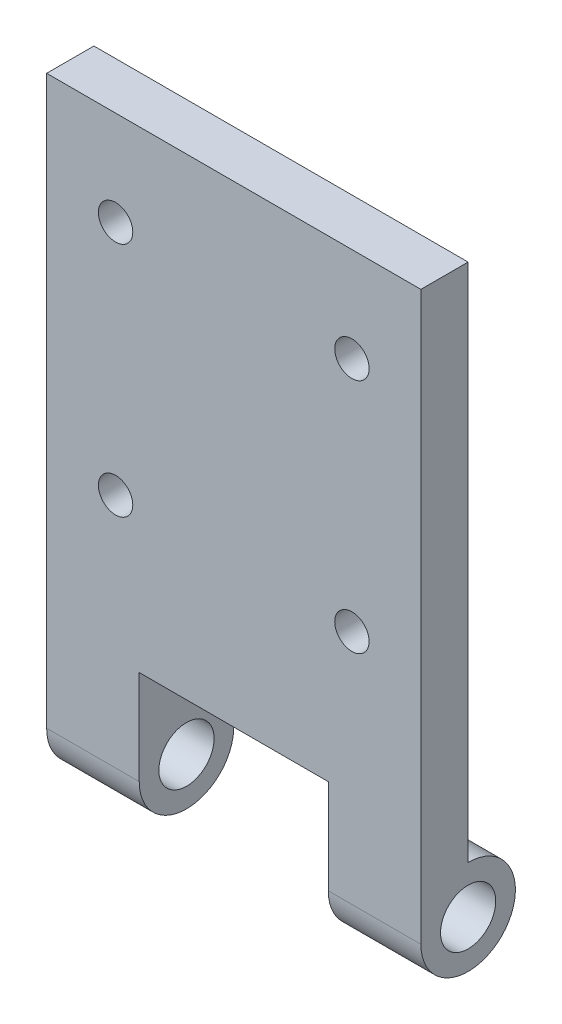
from build123d import *

# Parameters (mm, degrees)
ESQUISSE1_W             = 79.176240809
ESQUISSE1_H             = 120
ESQUISSE1_R             = 3.635601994
BOSS_EXTRU_1_DEPTH      = 10
ESQUISSE2_R             = 10
BOSS_EXTRU_2_DEPTH      = 79.176240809
ESQUISSE3_R             = 5.844948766
ENL_V_MAT_EXTRU_1_DEPTH = 145.114111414
ESQUISSE4_W             = 40
ESQUISSE4_H             = 33.818060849
ENL_V_MAT_EXTRU_2_DEPTH = 30


with BuildPart() as part:
    # Esquisse1 → Boss.-Extru.1 (new body)
    with BuildSketch(Plane.XY):
        with Locations((39.588120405, 60)):
            Rectangle(ESQUISSE1_W, ESQUISSE1_H)
        with Locations((14.588120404, 50)):
            Circle(ESQUISSE1_R, mode=Mode.SUBTRACT)
        with Locations((14.588120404, 100)):
            Circle(ESQUISSE1_R, mode=Mode.SUBTRACT)
        with Locations(Location((64.588120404, 100, 0), (0, 0, 180))):
            Circle(ESQUISSE1_R, mode=Mode.SUBTRACT)
        with Locations(Location((64.588120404, 50, 0), (0, 0, 180))):
            Circle(ESQUISSE1_R, mode=Mode.SUBTRACT)
    extrude(amount=BOSS_EXTRU_1_DEPTH)

    # Esquisse2 → Boss.-Extru.2 (add)
    with BuildSketch(Plane(origin=(79.176240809, 0, 0), x_dir=(0, 0, -1), z_dir=(1, 0, 0))):
        Circle(ESQUISSE2_R)
    extrude(amount=-BOSS_EXTRU_2_DEPTH)

    # Esquisse3 → Enl_v. mat.-Extru.1 (cut, through all)
    with BuildSketch(Plane(origin=(79.176240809, 0, 0), x_dir=(0, 0, -1), z_dir=(1, 0, 0))):
        with Locations(Location((0, 0, 0), (0, 0, 90))):
            Circle(ESQUISSE3_R)
    extrude(amount=-ENL_V_MAT_EXTRU_1_DEPTH, mode=Mode.SUBTRACT)

    # Esquisse4 → Enl_v. mat.-Extru.2 (cut)
    with BuildSketch(Plane.XY.offset(10)):
        with Locations((39.588120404, 3.090969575)):
            Rectangle(ESQUISSE4_W, ESQUISSE4_H)
    extrude(amount=-ENL_V_MAT_EXTRU_2_DEPTH, mode=Mode.SUBTRACT)


solid = part.part
